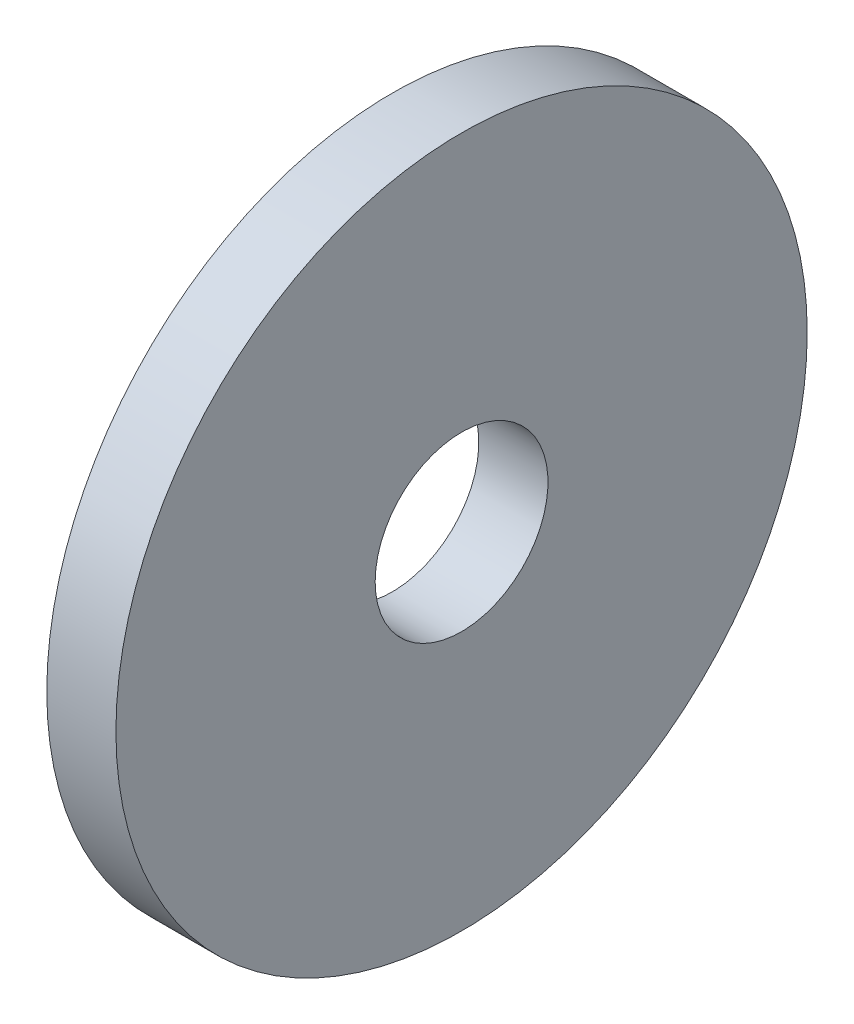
from build123d import *

# Parameters (mm, degrees)
SKETCH1_R      = 6.7818
SKETCH1_R_2    = 1.69545
EXTRUDE1_DEPTH = 1.35636


with BuildPart() as part:
    # Sketch1 → Extrude1 (new body)
    with BuildSketch(Plane(origin=(0, 0, 0), x_dir=(0, 0, -1), z_dir=(1, 0, 0))):
        with Locations(Location((0, 0, 0), (0, 0, 180))):
            Circle(SKETCH1_R)
        with Locations(Location((0, 0, 0), (0, 0, 180))):
            Circle(SKETCH1_R_2, mode=Mode.SUBTRACT)
    extrude(amount=EXTRUDE1_DEPTH)


solid = part.part
